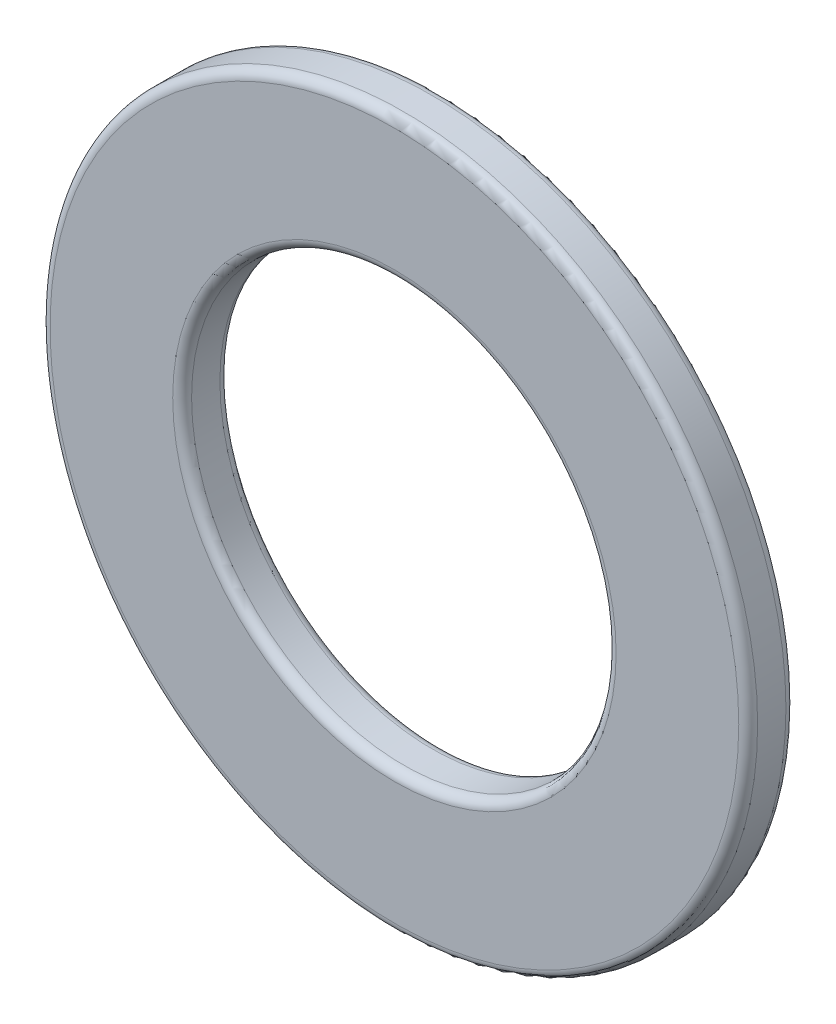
from build123d import *

# Parameters (mm, degrees)
SKETCH_1_R      = 7.5
SKETCH_1_R_2    = 4.5
EXTRUDE_1_DEPTH = 0.5
FILLET_1_R      = 0.2


with BuildPart() as part:
    # Sketch 1 → Extrude 1 (new, symmetric)
    with BuildSketch(Plane.XY):
        Circle(SKETCH_1_R)
        Circle(SKETCH_1_R_2, mode=Mode.SUBTRACT)
    extrude(amount=EXTRUDE_1_DEPTH, both=True)

    # Fillet 1
    fillet_1_edges = [part.edges().sort_by_distance(p)[0] for p in [
        (-7.5, 0, -0.5),
        (-7.5, 0, 0.5),
        (-4.5, 0, -0.5),
        (-4.5, 0, 0.5),
    ]]
    fillet(fillet_1_edges, radius=FILLET_1_R)


solid = part.part
